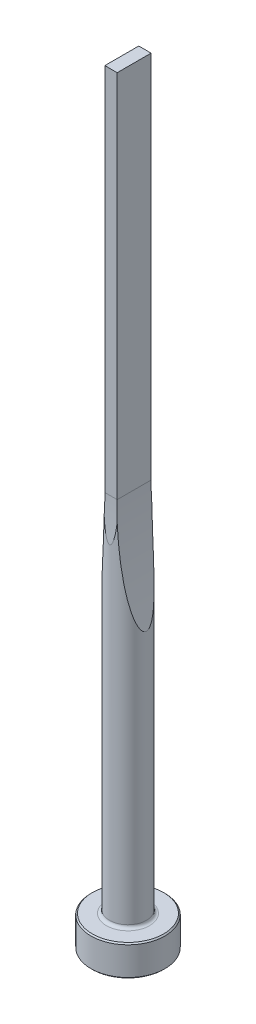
from build123d import *

# Parameters (mm, degrees)
CUT_EXTRUDE1_DEPTH = 5
CUT_EXTRUDE2_DEPTH = 5


with BuildPart() as part:
    # Sketch1 → Revolve1 (revolve)
    with BuildSketch(Plane.XY, mode=Mode.PRIVATE) as revolve1_sk:
        with BuildLine():
            Line((0, 0), (5.8, 0))
            Line((5.8, 0), (6, 0.2))
            Line((6, 0.2), (6, 4.8))
            Line((6, 4.8), (5.8, 5))
            Line((5.8, 5), (3.5, 5))
            ThreePointArc((3.5, 5), (3.146446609, 5.146446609), (3, 5.5))
            Line((3, 5.5), (3, 125))
            Line((3, 125), (0, 125))
            Line((0, 125), (0, 0))
        make_face()
    revolve(revolve1_sk.sketch.rotate(Axis((0, 125, 0), (0, -1, 0)), 180), axis=Axis((0, 125, 0), (0, -1, 0)))

    # Sketch2 → Cut-Extrude1 (cut, symmetric)
    with BuildSketch(Plane.XY):
        with BuildLine():
            Line((1, 125), (1, 65))
            ThreePointArc((1, 65), (1.501396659, 55.513167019), (3, 46.132037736))
            Line((3, 46.132037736), (3, 125))
            Line((3, 125), (1, 125))
        make_face()
        with BuildLine():
            Line((-1, 125), (-1, 65))
            ThreePointArc((-1, 65), (-1.501396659, 55.513167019), (-3, 46.132037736))
            Line((-3, 46.132037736), (-3, 125))
            Line((-3, 125), (-1, 125))
        make_face()
    extrude(amount=CUT_EXTRUDE1_DEPTH, both=True, mode=Mode.SUBTRACT)

    # Sketch3 → Cut-Extrude2 (cut, symmetric)
    with BuildSketch(Plane(origin=(0, 0, 0), x_dir=(0, 0, -1), z_dir=(1, 0, 0))):
        with BuildLine():
            Line((2.75, 125), (2.75, 65))
            ThreePointArc((2.75, 65), (2.812521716, 61.645898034), (3, 58.296456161))
            Line((3, 58.296456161), (3, 125))
            Line((3, 125), (2.75, 125))
        make_face()
        with BuildLine():
            Line((-2.75, 125), (-2.75, 65))
            ThreePointArc((-2.75, 65), (-2.812521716, 61.645898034), (-3, 58.296456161))
            Line((-3, 58.296456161), (-3, 125))
            Line((-3, 125), (-2.75, 125))
        make_face()
    extrude(amount=CUT_EXTRUDE2_DEPTH, both=True, mode=Mode.SUBTRACT)


solid = part.part
